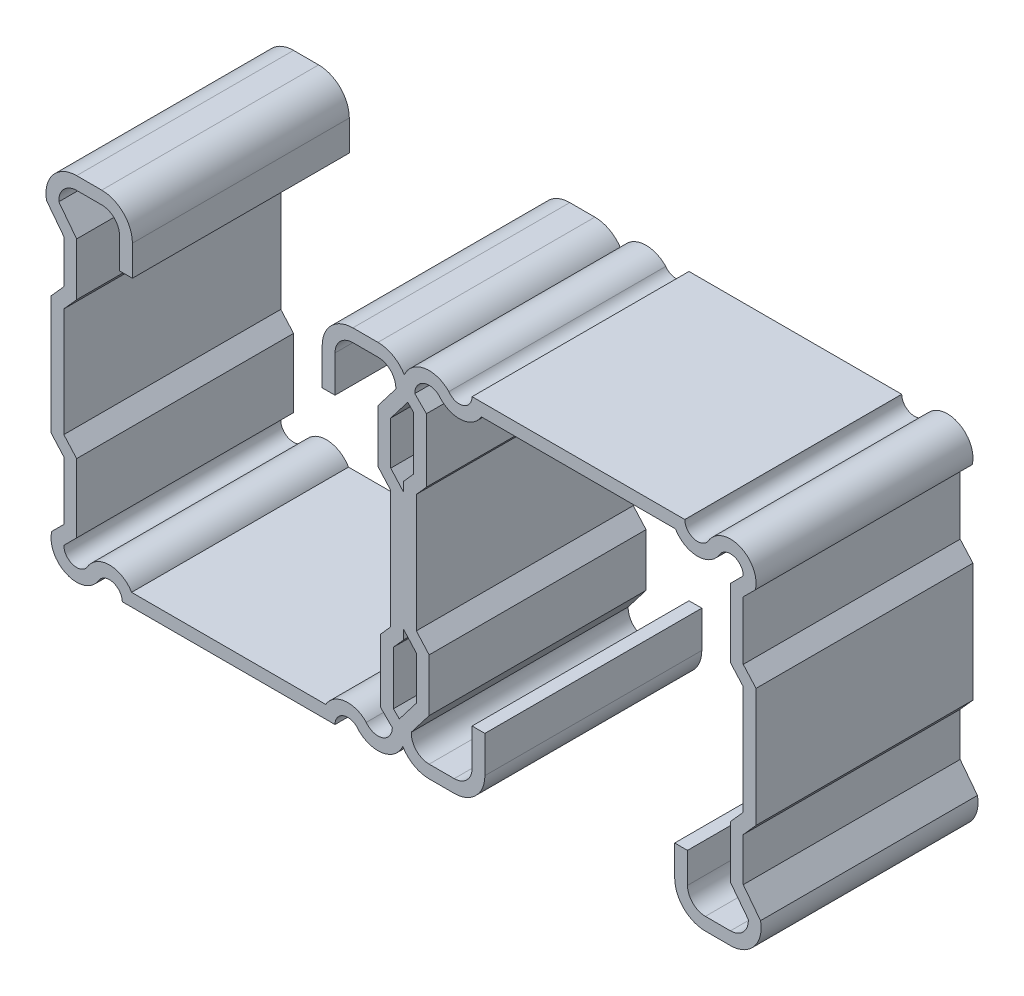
from build123d import *

# Parameters (mm, degrees)
BASE_EXTRUDE_DEPTH = 12.7
CIRPATTERN1_COUNT  = 2


with BuildPart() as part:
    # Sketch1 → Base-Extrude (new, symmetric)
    with BuildSketch(Plane(origin=(-20.32, 17.78, 0), x_dir=(1, 0, 0), z_dir=(0, 0, 1))):
        with BuildLine():
            Line((17.3228, 17.075886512), (19.412382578, 19.800133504))
            ThreePointArc((19.412382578, 19.800133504), (18.838545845, 21.346344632), (17.3228, 21.9964))
            Line((17.3228, 21.9964), (14.38577367, 21.9964))
            ThreePointArc((14.38577367, 21.9964), (12.906383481, 21.383616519), (12.2936, 19.90422633))
            Line((12.2936, 19.90422633), (12.2936, 15.61465))
            Line((12.2936, 15.61465), (10.795, 15.61465))
            Line((10.795, 15.61465), (10.795, 19.90422633))
            ThreePointArc((10.795, 19.90422633), (11.846713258, 22.443286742), (14.38577367, 23.495))
            Line((14.38577367, 23.495), (17.3228, 23.495))
            ThreePointArc((17.3228, 23.495), (20.097934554, 22.182884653), (20.844928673, 19.2054666))
            Line((20.844928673, 19.2054666), (18.8214, 16.567335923))
            Line((18.8214, 16.567335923), (18.8214, 11.485729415))
            Line((18.8214, 11.485729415), (20.32, 9.8028125))
            Line((20.32, 9.8028125), (20.32, -5.180962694))
            Line((20.32, -5.180962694), (19.1389, -6.507329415))
            Line((19.1389, -6.507329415), (19.1389, -12.757931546))
            Line((19.1389, -12.757931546), (20.424084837, -14.043116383))
            ThreePointArc((20.424084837, -14.043116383), (18.821804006, -17.54486751), (15.019825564, -16.932883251))
            ThreePointArc((15.019825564, -16.932883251), (13.348875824, -16.363652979), (12.29528328, -17.78))
            Line((12.29528328, -17.78), (-12.61278328, -17.78))
            ThreePointArc((-12.61278328, -17.78), (-13.666375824, -16.363652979), (-15.337325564, -16.932883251))
            ThreePointArc((-15.337325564, -16.932883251), (-19.047442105, -18.270236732), (-20.870958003, -14.773342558))
            Line((-20.870958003, -14.773342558), (-19.4564, -13.358784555))
            Line((-19.4564, -13.358784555), (-19.4564, -6.507329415))
            Line((-19.4564, -6.507329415), (-20.955, -4.8244125))
            Line((-20.955, -4.8244125), (-20.955, 9.0662125))
            Line((-20.955, 9.0662125), (-19.4564, 10.749129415))
            Line((-19.4564, 10.749129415), (-19.4564, 15.830735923))
            Line((-19.4564, 15.830735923), (-21.479928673, 18.4688666))
            ThreePointArc((-21.479928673, 18.4688666), (-20.732934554, 21.446284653), (-17.9578, 22.7584))
            Line((-17.9578, 22.7584), (-15.02077367, 22.7584))
            ThreePointArc((-15.02077367, 22.7584), (-12.481713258, 21.706686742), (-11.43, 19.16762633))
            Line((-11.43, 19.16762633), (-11.43, 15.61465))
            Line((-11.43, 15.61465), (-12.9286, 15.61465))
            Line((-12.9286, 15.61465), (-12.9286, 19.16762633))
            ThreePointArc((-12.9286, 19.16762633), (-13.541383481, 20.647016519), (-15.02077367, 21.2598))
            Line((-15.02077367, 21.2598), (-17.9578, 21.2598))
            ThreePointArc((-17.9578, 21.2598), (-19.473545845, 20.609744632), (-20.047382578, 19.063533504))
            Line((-20.047382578, 19.063533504), (-17.9578, 16.339286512))
            Line((-17.9578, 16.339286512), (-17.9578, 10.17860201))
            Line((-17.9578, 10.17860201), (-19.4564, 8.495685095))
            Line((-19.4564, 8.495685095), (-19.4564, -4.253885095))
            Line((-19.4564, -4.253885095), (-17.9578, -5.93680201))
            Line((-17.9578, -5.93680201), (-17.9578, -13.979525))
            Line((-17.9578, -13.979525), (-19.4564, -15.478125))
            ThreePointArc((-19.4564, -15.478125), (-18.409738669, -16.906954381), (-16.731785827, -16.33992034))
            ThreePointArc((-16.731785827, -16.33992034), (-14.14499029, -14.797667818), (-11.524190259, -16.2814))
            Line((-11.524190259, -16.2814), (11.206690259, -16.2814))
            ThreePointArc((11.206690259, -16.2814), (13.441553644, -14.818250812), (15.956217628, -15.719297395))
            ThreePointArc((15.956217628, -15.719297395), (17.836242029, -16.3415136), (19.00315301, -14.741525))
            Line((19.00315301, -14.741525), (17.6403, -13.37867199))
            Line((17.6403, -13.37867199), (17.6403, -5.93680201))
            Line((17.6403, -5.93680201), (18.8214, -4.610435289))
            Line((18.8214, -4.610435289), (18.8214, 9.232285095))
            Line((18.8214, 9.232285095), (17.3228, 10.91520201))
            Line((17.3228, 10.91520201), (17.3228, 17.075886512))
        make_face()
    base_extrude = extrude(amount=BASE_EXTRUDE_DEPTH, both=True)

    # CirPattern1: Base-Extrude ×2 about axis
    cirpattern1_axis = Axis((0, 20.6375, 0), (0, 0, 1))
    for i in range(1, CIRPATTERN1_COUNT):
        add(base_extrude.rotate(cirpattern1_axis, i * 360 / CIRPATTERN1_COUNT))


solid = part.part
